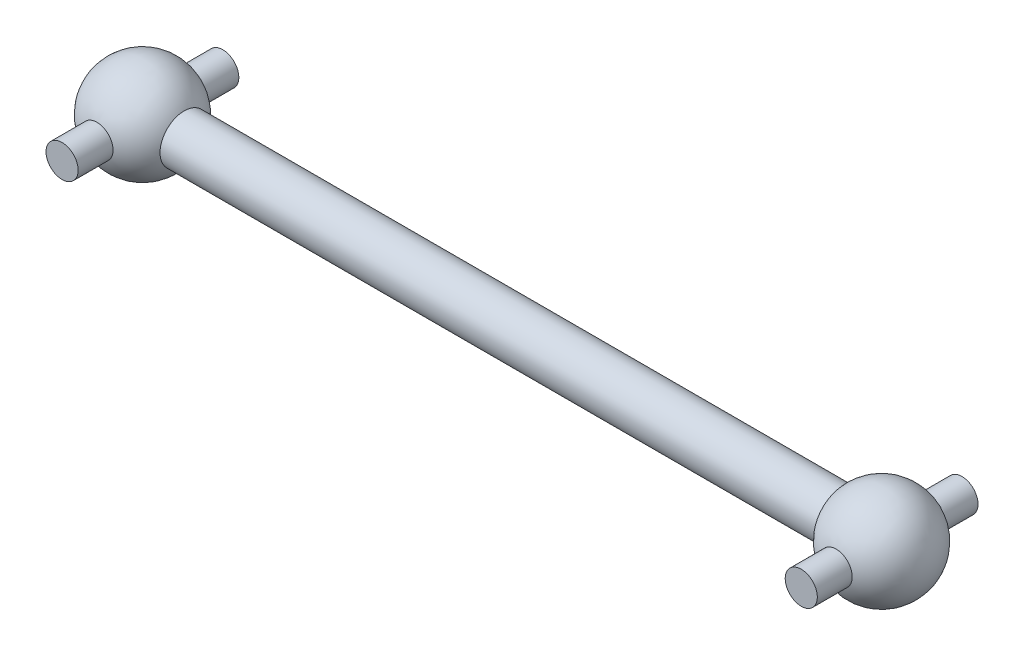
ISO-10303-21;
HEADER;
FILE_DESCRIPTION(('STEP AP214'),'2;1');
FILE_NAME('part.step','',(''),(''),'','','');
FILE_SCHEMA(('AUTOMOTIVE_DESIGN { 1 0 10303 214 1 1 1 1 }'));
ENDSEC;
DATA;
#1=APPLICATION_CONTEXT('core data for automotive mechanical design processes');
#2=APPLICATION_PROTOCOL_DEFINITION('international standard','automotive_design',2000,#1);
#3=PRODUCT_CONTEXT('',#1,'mechanical');
#4=PRODUCT('Part','Part','',(#3));
#5=PRODUCT_RELATED_PRODUCT_CATEGORY('part','',(#4));
#6=PRODUCT_DEFINITION_FORMATION('','',#4);
#7=PRODUCT_DEFINITION_CONTEXT('part definition',#1,'design');
#8=PRODUCT_DEFINITION('design','',#6,#7);
#9=PRODUCT_DEFINITION_SHAPE('','',#8);
#10=(LENGTH_UNIT() NAMED_UNIT(*) SI_UNIT(.MILLI.,.METRE.));
#11=(NAMED_UNIT(*) PLANE_ANGLE_UNIT() SI_UNIT($,.RADIAN.));
#12=(NAMED_UNIT(*) SI_UNIT($,.STERADIAN.) SOLID_ANGLE_UNIT());
#13=UNCERTAINTY_MEASURE_WITH_UNIT(LENGTH_MEASURE(1.E-05),#10,'distance_accuracy_value','');
#14=(GEOMETRIC_REPRESENTATION_CONTEXT(3) GLOBAL_UNCERTAINTY_ASSIGNED_CONTEXT((#13)) GLOBAL_UNIT_ASSIGNED_CONTEXT((#10,
#11,#12)) REPRESENTATION_CONTEXT('',''));
#15=CARTESIAN_POINT('',(0.,0.,0.));
#16=DIRECTION('',(0.,0.,1.));
#17=DIRECTION('',(1.,0.,0.));
#18=AXIS2_PLACEMENT_3D('',#15,#16,#17);
#19=CARTESIAN_POINT('',(23.,0.,0.));
#20=DIRECTION('',(-1.,0.,0.));
#21=DIRECTION('',(0.,1.,0.));
#22=AXIS2_PLACEMENT_3D('',#19,#20,#21);
#23=SPHERICAL_SURFACE('',#22,3.);
#24=CARTESIAN_POINT('',(23.,0.,2.82842712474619));
#25=DIRECTION('',(0.,0.,-1.));
#26=DIRECTION('',(-1.,0.,0.));
#27=AXIS2_PLACEMENT_3D('',#24,#25,#26);
#28=CIRCLE('',#27,1.);
#29=CARTESIAN_POINT('',(22.,0.,2.82842712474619));
#30=VERTEX_POINT('',#29);
#31=EDGE_CURVE('E354',#30,#30,#28,.F.);
#32=ORIENTED_EDGE('',*,*,#31,.F.);
#33=EDGE_LOOP('',(#32));
#34=FACE_BOUND('',#33,.T.);
#35=CARTESIAN_POINT('',(20.4019237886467,0.,0.));
#36=DIRECTION('',(-1.,0.,0.));
#37=DIRECTION('',(0.,0.,1.));
#38=AXIS2_PLACEMENT_3D('',#35,#36,#37);
#39=CIRCLE('',#38,1.50000000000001);
#40=CARTESIAN_POINT('',(20.4019237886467,0.,1.50000000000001));
#41=VERTEX_POINT('',#40);
#42=EDGE_CURVE('E370',#41,#41,#39,.T.);
#43=ORIENTED_EDGE('',*,*,#42,.F.);
#44=EDGE_LOOP('',(#43));
#45=FACE_BOUND('',#44,.T.);
#46=CARTESIAN_POINT('',(23.,0.,-2.82842712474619));
#47=DIRECTION('',(0.,0.,1.));
#48=DIRECTION('',(1.,0.,0.));
#49=AXIS2_PLACEMENT_3D('',#46,#47,#48);
#50=CIRCLE('',#49,1.);
#51=CARTESIAN_POINT('',(24.,0.,-2.82842712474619));
#52=VERTEX_POINT('',#51);
#53=EDGE_CURVE('E10',#52,#52,#50,.F.);
#54=ORIENTED_EDGE('',*,*,#53,.F.);
#55=EDGE_LOOP('',(#54));
#56=FACE_BOUND('',#55,.T.);
#57=ADVANCED_FACE('F348',(#34,#45,#56),#23,.T.);
#58=CARTESIAN_POINT('',(-23.,0.,0.));
#59=DIRECTION('',(-1.,0.,0.));
#60=DIRECTION('',(0.,1.,0.));
#61=AXIS2_PLACEMENT_3D('',#58,#59,#60);
#62=SPHERICAL_SURFACE('',#61,3.);
#63=CARTESIAN_POINT('',(-23.,0.,2.82842712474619));
#64=DIRECTION('',(0.,0.,-1.));
#65=DIRECTION('',(-1.,0.,0.));
#66=AXIS2_PLACEMENT_3D('',#63,#64,#65);
#67=CIRCLE('',#66,1.);
#68=CARTESIAN_POINT('',(-24.,0.,2.82842712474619));
#69=VERTEX_POINT('',#68);
#70=EDGE_CURVE('E362',#69,#69,#67,.F.);
#71=ORIENTED_EDGE('',*,*,#70,.F.);
#72=EDGE_LOOP('',(#71));
#73=FACE_BOUND('',#72,.T.);
#74=CARTESIAN_POINT('',(-20.4019237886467,0.,0.));
#75=DIRECTION('',(-1.,0.,0.));
#76=DIRECTION('',(0.,0.,1.));
#77=AXIS2_PLACEMENT_3D('',#74,#75,#76);
#78=CIRCLE('',#77,1.5);
#79=CARTESIAN_POINT('',(-20.4019237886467,0.,1.5));
#80=VERTEX_POINT('',#79);
#81=EDGE_CURVE('E367',#80,#80,#78,.T.);
#82=ORIENTED_EDGE('',*,*,#81,.T.);
#83=EDGE_LOOP('',(#82));
#84=FACE_BOUND('',#83,.T.);
#85=CARTESIAN_POINT('',(-23.,0.,-2.82842712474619));
#86=DIRECTION('',(0.,0.,1.));
#87=DIRECTION('',(1.,0.,0.));
#88=AXIS2_PLACEMENT_3D('',#85,#86,#87);
#89=CIRCLE('',#88,1.);
#90=CARTESIAN_POINT('',(-22.,0.,-2.82842712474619));
#91=VERTEX_POINT('',#90);
#92=EDGE_CURVE('E358',#91,#91,#89,.F.);
#93=ORIENTED_EDGE('',*,*,#92,.F.);
#94=EDGE_LOOP('',(#93));
#95=FACE_BOUND('',#94,.T.);
#96=ADVANCED_FACE('F398',(#73,#84,#95),#62,.T.);
#97=CARTESIAN_POINT('',(-25.7050966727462,0.,0.));
#98=DIRECTION('',(-1.,0.,0.));
#99=DIRECTION('',(0.,0.,1.));
#100=AXIS2_PLACEMENT_3D('',#97,#98,#99);
#101=CYLINDRICAL_SURFACE('',#100,1.5);
#102=ORIENTED_EDGE('',*,*,#81,.F.);
#103=EDGE_LOOP('',(#102));
#104=FACE_BOUND('',#103,.T.);
#105=ORIENTED_EDGE('',*,*,#42,.T.);
#106=EDGE_LOOP('',(#105));
#107=FACE_BOUND('',#106,.T.);
#108=ADVANCED_FACE('F403',(#104,#107),#101,.T.);
#109=CARTESIAN_POINT('',(-23.,0.,5.));
#110=DIRECTION('',(0.,0.,1.));
#111=DIRECTION('',(1.,0.,0.));
#112=AXIS2_PLACEMENT_3D('',#109,#110,#111);
#113=PLANE('',#112);
#114=CARTESIAN_POINT('',(-23.,0.,5.));
#115=DIRECTION('',(0.,0.,1.));
#116=DIRECTION('',(1.,0.,0.));
#117=AXIS2_PLACEMENT_3D('',#114,#115,#116);
#118=CIRCLE('',#117,1.);
#119=CARTESIAN_POINT('',(-22.,0.,5.));
#120=VERTEX_POINT('',#119);
#121=EDGE_CURVE('E373',#120,#120,#118,.T.);
#122=ORIENTED_EDGE('',*,*,#121,.T.);
#123=EDGE_LOOP('',(#122));
#124=FACE_BOUND('',#123,.T.);
#125=ADVANCED_FACE('F410',(#124),#113,.T.);
#126=CARTESIAN_POINT('',(-23.,0.,5.));
#127=DIRECTION('',(0.,0.,-1.));
#128=DIRECTION('',(-1.,0.,0.));
#129=AXIS2_PLACEMENT_3D('',#126,#127,#128);
#130=CYLINDRICAL_SURFACE('',#129,1.);
#131=ORIENTED_EDGE('',*,*,#121,.F.);
#132=EDGE_LOOP('',(#131));
#133=FACE_BOUND('',#132,.T.);
#134=ORIENTED_EDGE('',*,*,#70,.T.);
#135=EDGE_LOOP('',(#134));
#136=FACE_BOUND('',#135,.T.);
#137=ADVANCED_FACE('F416',(#133,#136),#130,.T.);
#138=CARTESIAN_POINT('',(-23.,0.,-5.));
#139=DIRECTION('',(0.,0.,1.));
#140=DIRECTION('',(1.,0.,0.));
#141=AXIS2_PLACEMENT_3D('',#138,#139,#140);
#142=CIRCLE('',#141,1.);
#143=CARTESIAN_POINT('',(-22.,0.,-5.));
#144=VERTEX_POINT('',#143);
#145=EDGE_CURVE('E376',#144,#144,#142,.T.);
#146=ORIENTED_EDGE('',*,*,#145,.T.);
#147=EDGE_LOOP('',(#146));
#148=FACE_BOUND('',#147,.T.);
#149=ORIENTED_EDGE('',*,*,#92,.T.);
#150=EDGE_LOOP('',(#149));
#151=FACE_BOUND('',#150,.T.);
#152=ADVANCED_FACE('F421',(#148,#151),#130,.T.);
#153=CARTESIAN_POINT('',(-23.,0.,-5.));
#154=DIRECTION('',(0.,0.,1.));
#155=DIRECTION('',(1.,0.,0.));
#156=AXIS2_PLACEMENT_3D('',#153,#154,#155);
#157=PLANE('',#156);
#158=ORIENTED_EDGE('',*,*,#145,.F.);
#159=EDGE_LOOP('',(#158));
#160=FACE_BOUND('',#159,.T.);
#161=ADVANCED_FACE('F423',(#160),#157,.F.);
#162=CARTESIAN_POINT('',(23.,0.,5.));
#163=DIRECTION('',(0.,0.,-1.));
#164=DIRECTION('',(-1.,0.,0.));
#165=AXIS2_PLACEMENT_3D('',#162,#163,#164);
#166=PLANE('',#165);
#167=CARTESIAN_POINT('',(23.,0.,5.));
#168=DIRECTION('',(0.,0.,1.));
#169=DIRECTION('',(-1.,0.,0.));
#170=AXIS2_PLACEMENT_3D('',#167,#168,#169);
#171=CIRCLE('',#170,1.);
#172=CARTESIAN_POINT('',(22.,0.,5.));
#173=VERTEX_POINT('',#172);
#174=EDGE_CURVE('E379',#173,#173,#171,.T.);
#175=ORIENTED_EDGE('',*,*,#174,.T.);
#176=EDGE_LOOP('',(#175));
#177=FACE_BOUND('',#176,.T.);
#178=ADVANCED_FACE('F427',(#177),#166,.F.);
#179=CARTESIAN_POINT('',(23.,0.,5.));
#180=DIRECTION('',(0.,0.,-1.));
#181=DIRECTION('',(-1.,0.,0.));
#182=AXIS2_PLACEMENT_3D('',#179,#180,#181);
#183=CYLINDRICAL_SURFACE('',#182,1.);
#184=ORIENTED_EDGE('',*,*,#174,.F.);
#185=EDGE_LOOP('',(#184));
#186=FACE_BOUND('',#185,.T.);
#187=ORIENTED_EDGE('',*,*,#31,.T.);
#188=EDGE_LOOP('',(#187));
#189=FACE_BOUND('',#188,.T.);
#190=ADVANCED_FACE('F394',(#186,#189),#183,.T.);
#191=CARTESIAN_POINT('',(23.,0.,-5.));
#192=DIRECTION('',(0.,0.,1.));
#193=DIRECTION('',(-1.,0.,0.));
#194=AXIS2_PLACEMENT_3D('',#191,#192,#193);
#195=CIRCLE('',#194,1.);
#196=CARTESIAN_POINT('',(22.,0.,-5.));
#197=VERTEX_POINT('',#196);
#198=EDGE_CURVE('E382',#197,#197,#195,.T.);
#199=ORIENTED_EDGE('',*,*,#198,.T.);
#200=EDGE_LOOP('',(#199));
#201=FACE_BOUND('',#200,.T.);
#202=ORIENTED_EDGE('',*,*,#53,.T.);
#203=EDGE_LOOP('',(#202));
#204=FACE_BOUND('',#203,.T.);
#205=ADVANCED_FACE('F386',(#201,#204),#183,.T.);
#206=CARTESIAN_POINT('',(23.,0.,-5.));
#207=DIRECTION('',(0.,0.,-1.));
#208=DIRECTION('',(-1.,0.,0.));
#209=AXIS2_PLACEMENT_3D('',#206,#207,#208);
#210=PLANE('',#209);
#211=ORIENTED_EDGE('',*,*,#198,.F.);
#212=EDGE_LOOP('',(#211));
#213=FACE_BOUND('',#212,.T.);
#214=ADVANCED_FACE('F388',(#213),#210,.T.);
#215=CLOSED_SHELL('',(#57,#96,#108,#125,#137,#152,#161,#178,#190,#205,#214));
#216=MANIFOLD_SOLID_BREP('B2',#215);
#217=ADVANCED_BREP_SHAPE_REPRESENTATION('',(#18,#216),#14);
#218=SHAPE_DEFINITION_REPRESENTATION(#9,#217);
ENDSEC;
END-ISO-10303-21;
